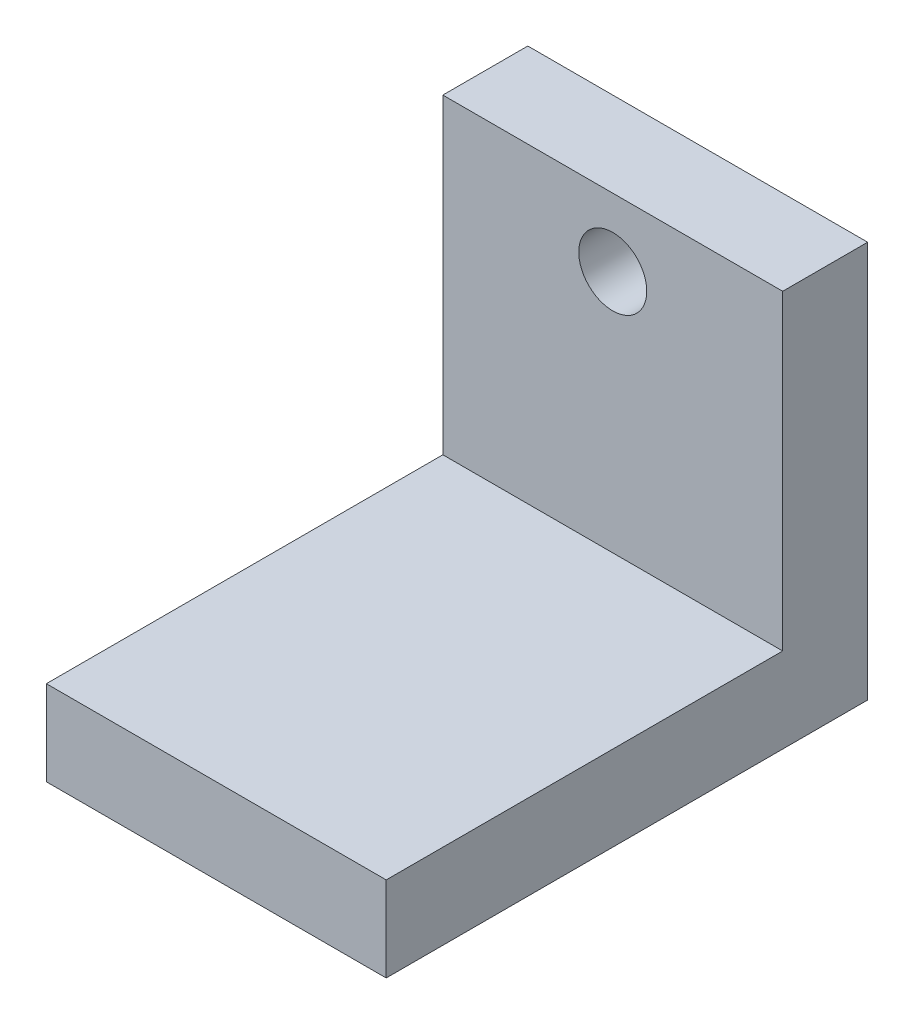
from build123d import *

# Parameters (mm, degrees)
BOSS_EXTRUDE1_DEPTH     = 30
CUT_EXTRUDE1_DEPTH      = 56.691673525
CUT_EXTRUDE1_DEPTH_BACK = 56.691673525
SKETCH3_R               = 3


with BuildPart() as part:
    # Sketch2 → Boss-Extrude1 (new body)
    with BuildSketch(Plane(origin=(0, 0, 0), x_dir=(0, 0, -1), z_dir=(1, 0, 0))):
        Polygon((-17.5, 3.75), (17.5, 3.75), (17.5, 31.25), (25, 31.25), (25, -3.75), (17.5, -3.75), (-17.5, -3.75), align=None)
    extrude(amount=BOSS_EXTRUDE1_DEPTH)

    # Sketch3 → Cut-Extrude1 (cut, two sides: drawn at the far end of the back side and taken through both)
    with BuildSketch(Plane.XY.offset(-17.5).offset(-CUT_EXTRUDE1_DEPTH_BACK)):
        with Locations((15, 25.25)):
            Circle(SKETCH3_R)
    extrude(amount=CUT_EXTRUDE1_DEPTH + CUT_EXTRUDE1_DEPTH_BACK, mode=Mode.SUBTRACT)


solid = part.part
